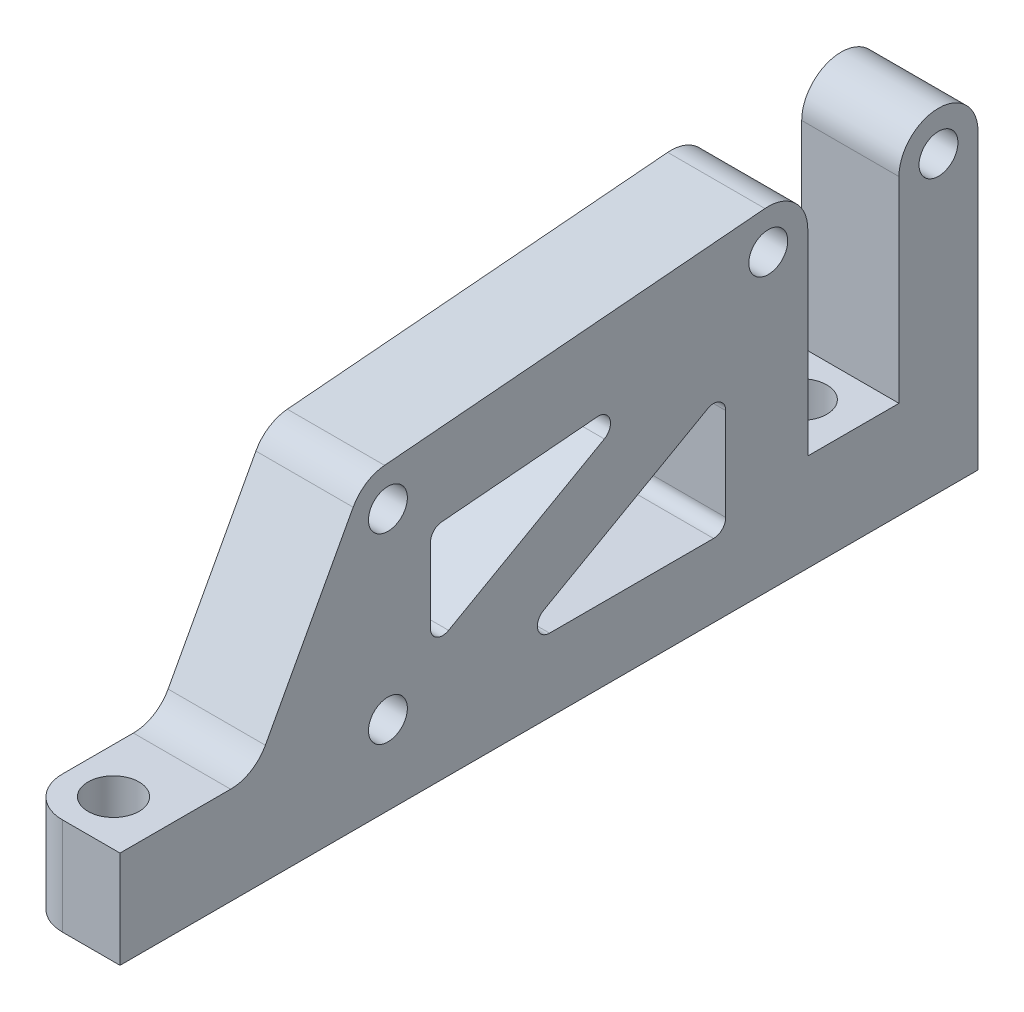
from build123d import *

# Parameters (mm, degrees)
SKETCH_1_R          = 1.6
EXTRUDE_1_DEPTH     = 8
SKETCH_2_R          = 2.1
CUT_EXTRUDE_1_DEPTH = 724.262226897
CUT_EXTRUDE_START   = -5
SKETCH_3_R          = 3
CUT_EXTRUDE_2_DEPTH = 719.003353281
FILLET_1_R          = 3.25
FILLET_2_R          = 3.25
CUT_EXTRUDE_3_DEPTH = 737.180038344
FILLET_3_R          = 1


with BuildPart() as part:
    # Sketch 1 → Extrude 1 (new body)
    with BuildSketch(Plane.ZY.offset(24)):
        with BuildLine():
            Line((668.99004445, 143.388402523), (702.023150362, 140.590263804))
            Line((702.023150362, 140.590263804), (711, 124))
            Line((711, 124), (722.034271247, 124))
            Line((722.034271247, 124), (722.034271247, 116))
            Line((722.034271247, 116), (651.465728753, 116))
            Line((651.465728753, 116), (651.465728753, 140.15))
            ThreePointArc((651.465728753, 140.15), (654.715728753, 143.4), (657.965728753, 140.15))
            Line((657.965728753, 140.15), (657.965728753, 124))
            Line((657.965728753, 124), (665.465728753, 124))
            Line((665.465728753, 124), (665.465728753, 140.15))
            ThreePointArc((665.465728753, 140.15), (666.516754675, 142.543117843), (668.99004445, 143.388402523))
        make_face()
        with Locations((654.715728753, 140.15)):
            Circle(SKETCH_1_R, mode=Mode.SUBTRACT)
        with Locations((668.715728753, 140.15)):
            Circle(SKETCH_1_R, mode=Mode.SUBTRACT)
        with Locations((700, 137.5)):
            Circle(SKETCH_1_R, mode=Mode.SUBTRACT)
        with Locations((700, 122.5)):
            Circle(SKETCH_1_R, mode=Mode.SUBTRACT)
    extrude(amount=EXTRUDE_1_DEPTH)

    # Sketch 2 → Cut-Extrude 1 (cut, through all)
    with BuildSketch(Plane.XZ.offset(-116)):
        with Locations(Location((-28.284271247, 718.284271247, 0), (0, 0, 270))):
            Circle(SKETCH_2_R)
        with Locations(Location((-28.284271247, 661.715728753, 0), (0, 0, 270))):
            Circle(SKETCH_2_R)
    extrude(amount=-CUT_EXTRUDE_1_DEPTH, mode=Mode.SUBTRACT)

    # Sketch 3 → Cut-Extrude 2 (cut, through all)
    with BuildSketch(Plane(origin=(0, 124, 0), x_dir=(1, 0, 0), z_dir=(0, 1, 0)).offset(CUT_EXTRUDE_START)):
        with Locations((-33.941125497, -668.786796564)):
            Circle(SKETCH_3_R)
        with Locations((-33.941125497, -711.213203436)):
            Circle(SKETCH_3_R)
    extrude(amount=-CUT_EXTRUDE_2_DEPTH, mode=Mode.SUBTRACT)

    # Fillet 1
    fillet_1_edges = [part.edges().sort_by_distance(p)[0] for p in [
        (-28, 140.590263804, 702.023150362),
        (-28, 124, 711),
    ]]
    fillet(fillet_1_edges, radius=FILLET_1_R)

    # Fillet 2
    fillet_2_edges = [part.edges().sort_by_distance(p)[0] for p in [
        (-32, 120, 722.034271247),
    ]]
    fillet(fillet_2_edges, radius=FILLET_2_R)

    # Sketch 4 → Cut-Extrude 3 (cut, through all)
    with BuildSketch(Plane.ZY.offset(32)):
        Polygon((678.203122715, 135.833816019), (696.5, 134.283940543), (696.5, 125.511060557), align=None)
        Polygon((672.215728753, 132.322755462), (690.512606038, 122), (672.215728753, 122), align=None)
    extrude(amount=-CUT_EXTRUDE_3_DEPTH, mode=Mode.SUBTRACT)

    # Fillet 3
    fillet_3_edges = [part.edges().sort_by_distance(p)[0] for p in [
        (-28, 122, 672.215728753),
        (-28, 132.322755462, 672.215728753),
        (-28, 122, 690.512606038),
        (-28, 125.511060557, 696.5),
        (-28, 135.833816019, 678.203122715),
        (-28, 134.283940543, 696.5),
    ]]
    fillet(fillet_3_edges, radius=FILLET_3_R)


solid = part.part
